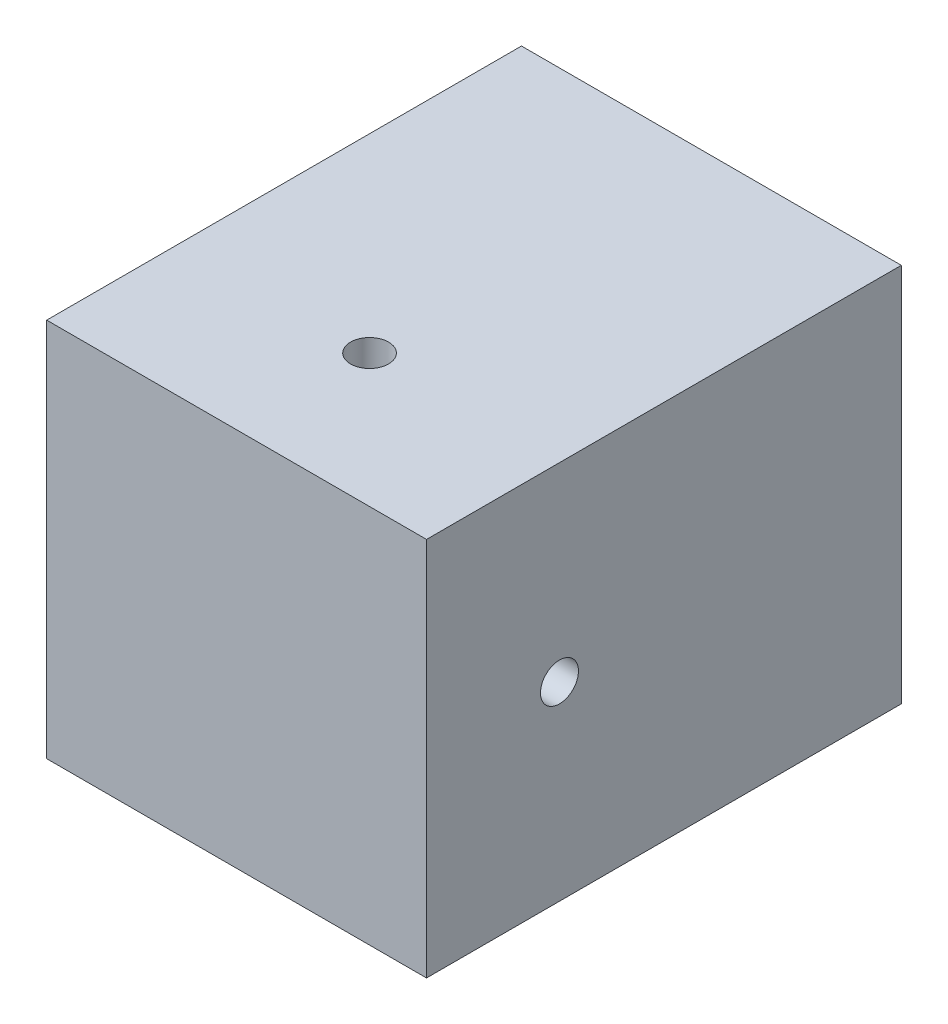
from build123d import *

# Parameters (mm, degrees)
SKETCH1_W           = 20
SKETCH1_H           = 20
BOSS_EXTRUDE1_DEPTH = 25
SKETCH2_R           = 1
CUT_EXTRUDE1_DEPTH  = 25
SKETCH3_R           = 1
CUT_EXTRUDE2_DEPTH  = 25


with BuildPart() as part:
    # Sketch1 → Boss-Extrude1 (new body)
    with BuildSketch(Plane.XY):
        Rectangle(SKETCH1_W, SKETCH1_H)
    extrude(amount=BOSS_EXTRUDE1_DEPTH)

    # Sketch2 → Cut-Extrude1 (cut)
    with BuildSketch(Plane(origin=(10, 0, 0), x_dir=(0, 0, -1), z_dir=(1, 0, 0))):
        with Locations(Location((-18, 0, 0), (0, 0, 90))):
            Circle(SKETCH2_R)
    extrude(amount=-CUT_EXTRUDE1_DEPTH, mode=Mode.SUBTRACT)

    # Sketch3 → Cut-Extrude2 (cut)
    with BuildSketch(Plane(origin=(0, 10, 0), x_dir=(1, 0, 0), z_dir=(0, 1, 0))):
        with Locations(Location((0, -18, 0), (0, 0, 270))):
            Circle(SKETCH3_R)
    extrude(amount=-CUT_EXTRUDE2_DEPTH, mode=Mode.SUBTRACT)


solid = part.part
